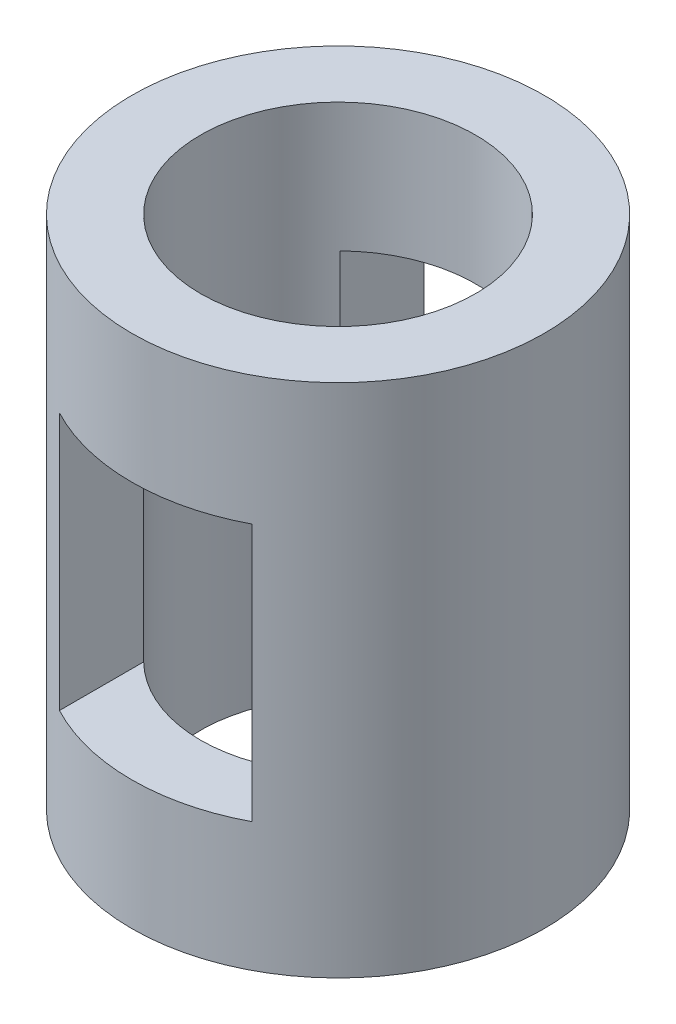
from build123d import *

# Parameters (mm, degrees)
SKETCH_1_R          = 30
EXTRUDE_1_DEPTH     = 75
SKETCH_4_W          = 28
SKETCH_4_H          = 37.5
CUT_EXTRUDE_3_DEPTH = 30
SKETCH_5_R          = 20
CUT_EXTRUDE_4_DEPTH = 87.168439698


with BuildPart() as part:
    # Sketch 1 → Extrude 1 (new body)
    with BuildSketch(Plane(origin=(0, 0, 0), x_dir=(1, 0, 0), z_dir=(0, 1, 0))):
        with Locations(Location((0, 0, 0), (0, 0, 270))):
            Circle(SKETCH_1_R)
    extrude(amount=EXTRUDE_1_DEPTH)

    # Sketch 4 → Cut-Extrude 3 (cut, symmetric)
    with BuildSketch(Plane.XY):
        with Locations((0, 37.5)):
            Rectangle(SKETCH_4_W, SKETCH_4_H)
    extrude(amount=CUT_EXTRUDE_3_DEPTH, both=True, mode=Mode.SUBTRACT)

    # Sketch 5 → Cut-Extrude 4 (cut, through all)
    with BuildSketch(Plane(origin=(0, 75, 0), x_dir=(1, 0, 0), z_dir=(0, 1, 0))):
        with Locations(Location((0, 0, 0), (0, 0, 270))):
            Circle(SKETCH_5_R)
    extrude(amount=-CUT_EXTRUDE_4_DEPTH, mode=Mode.SUBTRACT)


solid = part.part
